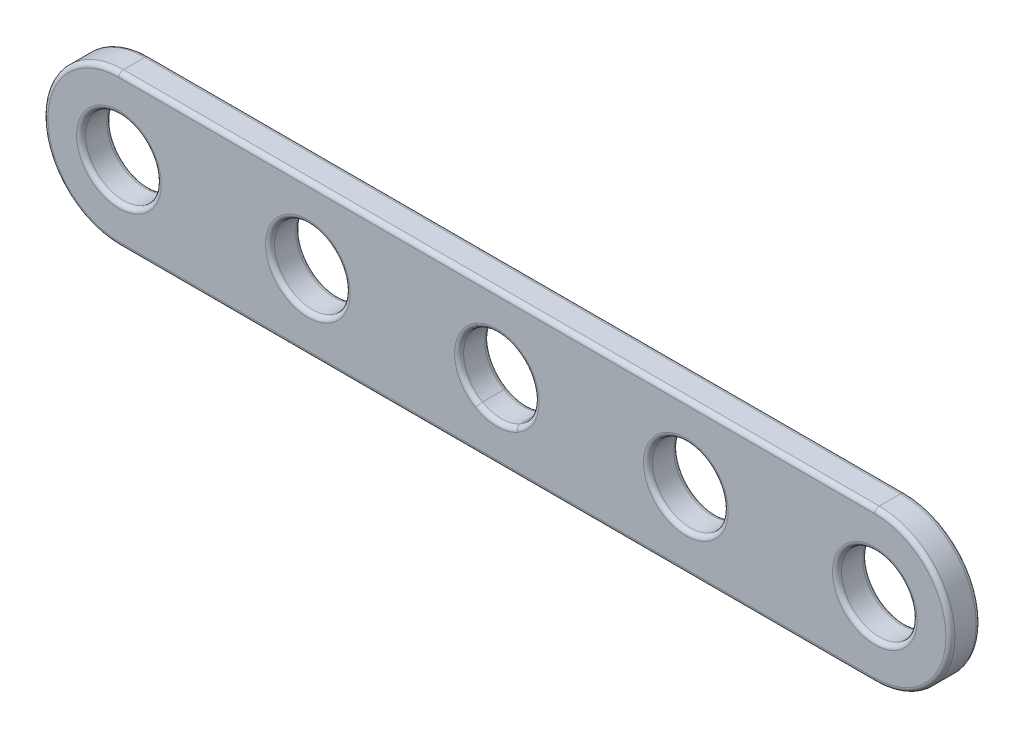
from build123d import *

# Parameters (mm, degrees)
BASE_EXTRUDE_DEPTH = 20
SKETCH2_R          = 25
CUT_EXTRUDE1_DEPTH = 560.374650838
LPATTERN1_COUNT    = 5
LPATTERN1_PITCH    = 125
FILLET1_R          = 3


with BuildPart() as part:
    # Sketch1 → Base-Extrude (new body)
    with BuildSketch(Plane.XY):
        with BuildLine():
            Line((0, 0), (500, 0))
            ThreePointArc((500, 0), (550, 50), (500, 100))
            Line((500, 100), (0, 100))
            ThreePointArc((0, 100), (-50, 50), (0, 0))
        make_face()
    extrude(amount=BASE_EXTRUDE_DEPTH)

    # Sketch2 → Cut-Extrude1 (cut, through all)
    with BuildSketch(Plane.XY.offset(20)):
        with Locations((0, 50)):
            Circle(SKETCH2_R)
    cut_extrude1 = extrude(amount=-CUT_EXTRUDE1_DEPTH, mode=Mode.SUBTRACT)

    # LPattern1: Cut-Extrude1 ×5
    with Locations(*[(i * LPATTERN1_PITCH, 0, 0) for i in range(1, LPATTERN1_COUNT)]):
        add(cut_extrude1, mode=Mode.SUBTRACT)

    # Fillet1
    fillet1_edges = [part.edges().sort_by_distance(p)[0] for p in [
        (550, 50, 20),
        (250, 100, 20),
        (-25, 50, 0),
        (-25, 50, 20),
        (100, 50, 0),
        (100, 50, 20),
        (225, 50, 0),
        (225, 50, 20),
        (350, 50, 0),
        (350, 50, 20),
        (475, 50, 0),
        (475, 50, 20),
        (225, 50, 0),
        (225, 50, 0),
        (225, 50, 0),
        (225, 50, 20),
        (225, 50, 20),
        (225, 50, 20),
        (-50, 50, 20),
        (250, 100, 0),
        (550, 50, 0),
        (250, 0, 0),
        (-50, 50, 0),
        (250, 0, 20),
    ]]
    fillet(fillet1_edges, radius=FILLET1_R)


solid = part.part
